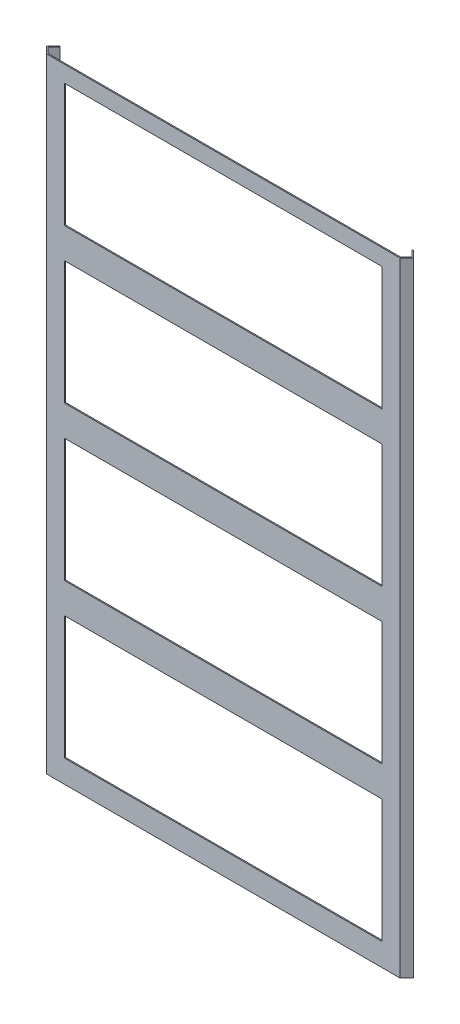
ISO-10303-21;
HEADER;
FILE_DESCRIPTION(('STEP AP214'),'2;1');
FILE_NAME('part.step','',(''),(''),'','','');
FILE_SCHEMA(('AUTOMOTIVE_DESIGN { 1 0 10303 214 1 1 1 1 }'));
ENDSEC;
DATA;
#1=APPLICATION_CONTEXT('core data for automotive mechanical design processes');
#2=APPLICATION_PROTOCOL_DEFINITION('international standard','automotive_design',2000,#1);
#3=PRODUCT_CONTEXT('',#1,'mechanical');
#4=PRODUCT('Part','Part','',(#3));
#5=PRODUCT_RELATED_PRODUCT_CATEGORY('part','',(#4));
#6=PRODUCT_DEFINITION_FORMATION('','',#4);
#7=PRODUCT_DEFINITION_CONTEXT('part definition',#1,'design');
#8=PRODUCT_DEFINITION('design','',#6,#7);
#9=PRODUCT_DEFINITION_SHAPE('','',#8);
#10=(LENGTH_UNIT() NAMED_UNIT(*) SI_UNIT(.MILLI.,.METRE.));
#11=(NAMED_UNIT(*) PLANE_ANGLE_UNIT() SI_UNIT($,.RADIAN.));
#12=(NAMED_UNIT(*) SI_UNIT($,.STERADIAN.) SOLID_ANGLE_UNIT());
#13=UNCERTAINTY_MEASURE_WITH_UNIT(LENGTH_MEASURE(1.E-05),#10,'distance_accuracy_value','');
#14=(GEOMETRIC_REPRESENTATION_CONTEXT(3) GLOBAL_UNCERTAINTY_ASSIGNED_CONTEXT((#13)) GLOBAL_UNIT_ASSIGNED_CONTEXT((#10,
#11,#12)) REPRESENTATION_CONTEXT('',''));
#15=CARTESIAN_POINT('',(0.,0.,0.));
#16=DIRECTION('',(0.,0.,1.));
#17=DIRECTION('',(1.,0.,0.));
#18=AXIS2_PLACEMENT_3D('',#15,#16,#17);
#19=CARTESIAN_POINT('',(0.,2276.,0.));
#20=DIRECTION('',(0.,0.,-1.));
#21=DIRECTION('',(-1.,0.,0.));
#22=AXIS2_PLACEMENT_3D('',#19,#20,#21);
#23=PLANE('',#22);
#24=DIRECTION('',(1.,0.,0.));
#25=VECTOR('',#24,1.);
#26=CARTESIAN_POINT('',(65.,1205.,0.));
#27=LINE('',#26,#25);
#28=CARTESIAN_POINT('',(65.,1205.,0.));
#29=VERTEX_POINT('',#28);
#30=CARTESIAN_POINT('',(1225.,1205.,0.));
#31=VERTEX_POINT('',#30);
#32=EDGE_CURVE('E339',#29,#31,#27,.T.);
#33=ORIENTED_EDGE('',*,*,#32,.T.);
#34=DIRECTION('',(0.,1.,0.));
#35=VECTOR('',#34,1.);
#36=CARTESIAN_POINT('',(1225.,1655.,0.));
#37=LINE('',#36,#35);
#38=CARTESIAN_POINT('',(1225.,1655.,0.));
#39=VERTEX_POINT('',#38);
#40=EDGE_CURVE('E335',#31,#39,#37,.T.);
#41=ORIENTED_EDGE('',*,*,#40,.T.);
#42=DIRECTION('',(-1.,0.,0.));
#43=VECTOR('',#42,1.);
#44=CARTESIAN_POINT('',(64.9999999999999,1655.,0.));
#45=LINE('',#44,#43);
#46=CARTESIAN_POINT('',(64.9999999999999,1655.,0.));
#47=VERTEX_POINT('',#46);
#48=EDGE_CURVE('E349',#39,#47,#45,.T.);
#49=ORIENTED_EDGE('',*,*,#48,.T.);
#50=DIRECTION('',(0.,-1.,0.));
#51=VECTOR('',#50,1.);
#52=CARTESIAN_POINT('',(64.9999999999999,1655.,0.));
#53=LINE('',#52,#51);
#54=EDGE_CURVE('E352',#47,#29,#53,.T.);
#55=ORIENTED_EDGE('',*,*,#54,.T.);
#56=EDGE_LOOP('',(#33,#41,#49,#55));
#57=FACE_BOUND('',#56,.T.);
#58=DIRECTION('',(1.,0.,0.));
#59=VECTOR('',#58,1.);
#60=CARTESIAN_POINT('',(65.0000000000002,83.,0.));
#61=LINE('',#60,#59);
#62=CARTESIAN_POINT('',(65.0000000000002,83.,0.));
#63=VERTEX_POINT('',#62);
#64=CARTESIAN_POINT('',(1225.,83.0000000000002,0.));
#65=VERTEX_POINT('',#64);
#66=EDGE_CURVE('E401',#63,#65,#61,.T.);
#67=ORIENTED_EDGE('',*,*,#66,.T.);
#68=DIRECTION('',(0.,1.,0.));
#69=VECTOR('',#68,1.);
#70=CARTESIAN_POINT('',(1225.,83.,0.));
#71=LINE('',#70,#69);
#72=CARTESIAN_POINT('',(1225.,533.,0.));
#73=VERTEX_POINT('',#72);
#74=EDGE_CURVE('E397',#65,#73,#71,.T.);
#75=ORIENTED_EDGE('',*,*,#74,.T.);
#76=DIRECTION('',(-1.,0.,0.));
#77=VECTOR('',#76,1.);
#78=CARTESIAN_POINT('',(65.0000000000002,533.,0.));
#79=LINE('',#78,#77);
#80=CARTESIAN_POINT('',(65.0000000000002,533.,0.));
#81=VERTEX_POINT('',#80);
#82=EDGE_CURVE('E411',#73,#81,#79,.T.);
#83=ORIENTED_EDGE('',*,*,#82,.T.);
#84=DIRECTION('',(0.,-1.,0.));
#85=VECTOR('',#84,1.);
#86=CARTESIAN_POINT('',(65.0000000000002,83.,0.));
#87=LINE('',#86,#85);
#88=EDGE_CURVE('E414',#81,#63,#87,.T.);
#89=ORIENTED_EDGE('',*,*,#88,.T.);
#90=EDGE_LOOP('',(#67,#75,#83,#89));
#91=FACE_BOUND('',#90,.T.);
#92=DIRECTION('',(1.,0.,0.));
#93=VECTOR('',#92,1.);
#94=CARTESIAN_POINT('',(65.,644.,0.));
#95=LINE('',#94,#93);
#96=CARTESIAN_POINT('',(65.,644.,0.));
#97=VERTEX_POINT('',#96);
#98=CARTESIAN_POINT('',(1225.,644.,0.));
#99=VERTEX_POINT('',#98);
#100=EDGE_CURVE('E370',#97,#99,#95,.T.);
#101=ORIENTED_EDGE('',*,*,#100,.T.);
#102=DIRECTION('',(0.,1.,0.));
#103=VECTOR('',#102,1.);
#104=CARTESIAN_POINT('',(1225.,1094.,0.));
#105=LINE('',#104,#103);
#106=CARTESIAN_POINT('',(1225.,1094.,0.));
#107=VERTEX_POINT('',#106);
#108=EDGE_CURVE('E366',#99,#107,#105,.T.);
#109=ORIENTED_EDGE('',*,*,#108,.T.);
#110=DIRECTION('',(-1.,0.,0.));
#111=VECTOR('',#110,1.);
#112=CARTESIAN_POINT('',(64.9999999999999,1094.,0.));
#113=LINE('',#112,#111);
#114=CARTESIAN_POINT('',(64.9999999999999,1094.,0.));
#115=VERTEX_POINT('',#114);
#116=EDGE_CURVE('E380',#107,#115,#113,.T.);
#117=ORIENTED_EDGE('',*,*,#116,.T.);
#118=DIRECTION('',(0.,-1.,0.));
#119=VECTOR('',#118,1.);
#120=CARTESIAN_POINT('',(64.9999999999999,1094.,0.));
#121=LINE('',#120,#119);
#122=EDGE_CURVE('E383',#115,#97,#121,.T.);
#123=ORIENTED_EDGE('',*,*,#122,.T.);
#124=EDGE_LOOP('',(#101,#109,#117,#123));
#125=FACE_BOUND('',#124,.T.);
#126=DIRECTION('',(1.,0.,0.));
#127=VECTOR('',#126,1.);
#128=CARTESIAN_POINT('',(64.9999999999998,1766.,0.));
#129=LINE('',#128,#127);
#130=CARTESIAN_POINT('',(64.9999999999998,1766.,0.));
#131=VERTEX_POINT('',#130);
#132=CARTESIAN_POINT('',(1225.,1766.,0.));
#133=VERTEX_POINT('',#132);
#134=EDGE_CURVE('E308',#131,#133,#129,.T.);
#135=ORIENTED_EDGE('',*,*,#134,.T.);
#136=DIRECTION('',(0.,1.,0.));
#137=VECTOR('',#136,1.);
#138=CARTESIAN_POINT('',(1225.,2216.,0.));
#139=LINE('',#138,#137);
#140=CARTESIAN_POINT('',(1225.,2216.,0.));
#141=VERTEX_POINT('',#140);
#142=EDGE_CURVE('E304',#133,#141,#139,.T.);
#143=ORIENTED_EDGE('',*,*,#142,.T.);
#144=DIRECTION('',(-1.,0.,0.));
#145=VECTOR('',#144,1.);
#146=CARTESIAN_POINT('',(64.9999999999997,2216.,0.));
#147=LINE('',#146,#145);
#148=CARTESIAN_POINT('',(64.9999999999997,2216.,0.));
#149=VERTEX_POINT('',#148);
#150=EDGE_CURVE('E318',#141,#149,#147,.T.);
#151=ORIENTED_EDGE('',*,*,#150,.T.);
#152=DIRECTION('',(0.,-1.,0.));
#153=VECTOR('',#152,1.);
#154=CARTESIAN_POINT('',(64.9999999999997,2216.,0.));
#155=LINE('',#154,#153);
#156=EDGE_CURVE('E321',#149,#131,#155,.T.);
#157=ORIENTED_EDGE('',*,*,#156,.T.);
#158=EDGE_LOOP('',(#135,#143,#151,#157));
#159=FACE_BOUND('',#158,.T.);
#160=DIRECTION('',(-1.,0.,0.));
#161=VECTOR('',#160,1.);
#162=CARTESIAN_POINT('',(0.,2276.,0.));
#163=LINE('',#162,#161);
#164=CARTESIAN_POINT('',(1288.34314575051,2276.,0.));
#165=VERTEX_POINT('',#164);
#166=CARTESIAN_POINT('',(1.65685424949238,2276.,0.));
#167=VERTEX_POINT('',#166);
#168=EDGE_CURVE('E37',#165,#167,#163,.T.);
#169=ORIENTED_EDGE('',*,*,#168,.F.);
#170=DIRECTION('',(0.,-1.,0.));
#171=VECTOR('',#170,1.);
#172=CARTESIAN_POINT('',(1288.34314575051,2276.,0.));
#173=LINE('',#172,#171);
#174=CARTESIAN_POINT('',(1288.34314575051,0.,0.));
#175=VERTEX_POINT('',#174);
#176=EDGE_CURVE('E262',#165,#175,#173,.T.);
#177=ORIENTED_EDGE('',*,*,#176,.T.);
#178=DIRECTION('',(1.,0.,0.));
#179=VECTOR('',#178,1.);
#180=CARTESIAN_POINT('',(0.,0.,0.));
#181=LINE('',#180,#179);
#182=CARTESIAN_POINT('',(1.65685424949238,0.,0.));
#183=VERTEX_POINT('',#182);
#184=EDGE_CURVE('E50',#183,#175,#181,.T.);
#185=ORIENTED_EDGE('',*,*,#184,.F.);
#186=DIRECTION('',(0.,-1.,0.));
#187=VECTOR('',#186,1.);
#188=CARTESIAN_POINT('',(1.65685424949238,2276.,0.));
#189=LINE('',#188,#187);
#190=EDGE_CURVE('E295',#167,#183,#189,.T.);
#191=ORIENTED_EDGE('',*,*,#190,.F.);
#192=EDGE_LOOP('',(#169,#177,#185,#191));
#193=FACE_BOUND('',#192,.T.);
#194=ADVANCED_FACE('F33',(#57,#91,#125,#159,#193),#23,.T.);
#195=CARTESIAN_POINT('',(0.,2276.,4.));
#196=DIRECTION('',(0.,0.,-1.));
#197=DIRECTION('',(-1.,0.,0.));
#198=AXIS2_PLACEMENT_3D('',#195,#196,#197);
#199=PLANE('',#198);
#200=DIRECTION('',(0.,1.,0.));
#201=VECTOR('',#200,1.);
#202=CARTESIAN_POINT('',(1225.,1655.,4.));
#203=LINE('',#202,#201);
#204=CARTESIAN_POINT('',(1225.,1205.,4.));
#205=VERTEX_POINT('',#204);
#206=CARTESIAN_POINT('',(1225.,1655.,4.));
#207=VERTEX_POINT('',#206);
#208=EDGE_CURVE('E336',#205,#207,#203,.T.);
#209=ORIENTED_EDGE('',*,*,#208,.F.);
#210=DIRECTION('',(1.,0.,0.));
#211=VECTOR('',#210,1.);
#212=CARTESIAN_POINT('',(65.,1205.,4.));
#213=LINE('',#212,#211);
#214=CARTESIAN_POINT('',(65.,1205.,4.));
#215=VERTEX_POINT('',#214);
#216=EDGE_CURVE('E344',#215,#205,#213,.T.);
#217=ORIENTED_EDGE('',*,*,#216,.F.);
#218=DIRECTION('',(0.,-1.,0.));
#219=VECTOR('',#218,1.);
#220=CARTESIAN_POINT('',(64.9999999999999,1655.,4.));
#221=LINE('',#220,#219);
#222=CARTESIAN_POINT('',(64.9999999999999,1655.,4.));
#223=VERTEX_POINT('',#222);
#224=EDGE_CURVE('E341',#223,#215,#221,.T.);
#225=ORIENTED_EDGE('',*,*,#224,.F.);
#226=DIRECTION('',(-1.,0.,0.));
#227=VECTOR('',#226,1.);
#228=CARTESIAN_POINT('',(64.9999999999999,1655.,4.));
#229=LINE('',#228,#227);
#230=EDGE_CURVE('E338',#207,#223,#229,.T.);
#231=ORIENTED_EDGE('',*,*,#230,.F.);
#232=EDGE_LOOP('',(#209,#217,#225,#231));
#233=FACE_BOUND('',#232,.T.);
#234=DIRECTION('',(0.,1.,0.));
#235=VECTOR('',#234,1.);
#236=CARTESIAN_POINT('',(1225.,83.,4.));
#237=LINE('',#236,#235);
#238=CARTESIAN_POINT('',(1225.,83.,4.));
#239=VERTEX_POINT('',#238);
#240=CARTESIAN_POINT('',(1225.,533.,4.));
#241=VERTEX_POINT('',#240);
#242=EDGE_CURVE('E398',#239,#241,#237,.T.);
#243=ORIENTED_EDGE('',*,*,#242,.F.);
#244=DIRECTION('',(1.,0.,0.));
#245=VECTOR('',#244,1.);
#246=CARTESIAN_POINT('',(65.0000000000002,83.,4.));
#247=LINE('',#246,#245);
#248=CARTESIAN_POINT('',(65.0000000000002,83.0000000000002,4.));
#249=VERTEX_POINT('',#248);
#250=EDGE_CURVE('E406',#249,#239,#247,.T.);
#251=ORIENTED_EDGE('',*,*,#250,.F.);
#252=DIRECTION('',(0.,-1.,0.));
#253=VECTOR('',#252,1.);
#254=CARTESIAN_POINT('',(65.0000000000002,83.,4.));
#255=LINE('',#254,#253);
#256=CARTESIAN_POINT('',(65.0000000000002,533.,4.));
#257=VERTEX_POINT('',#256);
#258=EDGE_CURVE('E403',#257,#249,#255,.T.);
#259=ORIENTED_EDGE('',*,*,#258,.F.);
#260=DIRECTION('',(-1.,0.,0.));
#261=VECTOR('',#260,1.);
#262=CARTESIAN_POINT('',(65.0000000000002,533.,4.));
#263=LINE('',#262,#261);
#264=EDGE_CURVE('E400',#241,#257,#263,.T.);
#265=ORIENTED_EDGE('',*,*,#264,.F.);
#266=EDGE_LOOP('',(#243,#251,#259,#265));
#267=FACE_BOUND('',#266,.T.);
#268=DIRECTION('',(0.,-1.,0.));
#269=VECTOR('',#268,1.);
#270=CARTESIAN_POINT('',(0.,0.,4.));
#271=LINE('',#270,#269);
#272=CARTESIAN_POINT('',(0.,2276.,4.));
#273=VERTEX_POINT('',#272);
#274=CARTESIAN_POINT('',(0.,0.,4.));
#275=VERTEX_POINT('',#274);
#276=EDGE_CURVE('E428',#273,#275,#271,.T.);
#277=ORIENTED_EDGE('',*,*,#276,.T.);
#278=DIRECTION('',(1.,0.,0.));
#279=VECTOR('',#278,1.);
#280=CARTESIAN_POINT('',(0.,0.,4.));
#281=LINE('',#280,#279);
#282=CARTESIAN_POINT('',(1290.,0.,4.));
#283=VERTEX_POINT('',#282);
#284=EDGE_CURVE('E431',#275,#283,#281,.T.);
#285=ORIENTED_EDGE('',*,*,#284,.T.);
#286=DIRECTION('',(0.,1.,0.));
#287=VECTOR('',#286,1.);
#288=CARTESIAN_POINT('',(1290.,0.,4.));
#289=LINE('',#288,#287);
#290=CARTESIAN_POINT('',(1290.,2276.,4.));
#291=VERTEX_POINT('',#290);
#292=EDGE_CURVE('E42',#283,#291,#289,.T.);
#293=ORIENTED_EDGE('',*,*,#292,.T.);
#294=DIRECTION('',(-1.,0.,0.));
#295=VECTOR('',#294,1.);
#296=CARTESIAN_POINT('',(0.,2276.,4.));
#297=LINE('',#296,#295);
#298=EDGE_CURVE('E11',#291,#273,#297,.T.);
#299=ORIENTED_EDGE('',*,*,#298,.T.);
#300=EDGE_LOOP('',(#277,#285,#293,#299));
#301=FACE_BOUND('',#300,.T.);
#302=DIRECTION('',(0.,1.,0.));
#303=VECTOR('',#302,1.);
#304=CARTESIAN_POINT('',(1225.,1094.,4.));
#305=LINE('',#304,#303);
#306=CARTESIAN_POINT('',(1225.,644.,4.));
#307=VERTEX_POINT('',#306);
#308=CARTESIAN_POINT('',(1225.,1094.,4.));
#309=VERTEX_POINT('',#308);
#310=EDGE_CURVE('E367',#307,#309,#305,.T.);
#311=ORIENTED_EDGE('',*,*,#310,.F.);
#312=DIRECTION('',(1.,0.,0.));
#313=VECTOR('',#312,1.);
#314=CARTESIAN_POINT('',(65.,644.,4.));
#315=LINE('',#314,#313);
#316=CARTESIAN_POINT('',(65.,644.,4.));
#317=VERTEX_POINT('',#316);
#318=EDGE_CURVE('E375',#317,#307,#315,.T.);
#319=ORIENTED_EDGE('',*,*,#318,.F.);
#320=DIRECTION('',(0.,-1.,0.));
#321=VECTOR('',#320,1.);
#322=CARTESIAN_POINT('',(64.9999999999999,1094.,4.));
#323=LINE('',#322,#321);
#324=CARTESIAN_POINT('',(64.9999999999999,1094.,4.));
#325=VERTEX_POINT('',#324);
#326=EDGE_CURVE('E372',#325,#317,#323,.T.);
#327=ORIENTED_EDGE('',*,*,#326,.F.);
#328=DIRECTION('',(-1.,0.,0.));
#329=VECTOR('',#328,1.);
#330=CARTESIAN_POINT('',(64.9999999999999,1094.,4.));
#331=LINE('',#330,#329);
#332=EDGE_CURVE('E369',#309,#325,#331,.T.);
#333=ORIENTED_EDGE('',*,*,#332,.F.);
#334=EDGE_LOOP('',(#311,#319,#327,#333));
#335=FACE_BOUND('',#334,.T.);
#336=DIRECTION('',(0.,1.,0.));
#337=VECTOR('',#336,1.);
#338=CARTESIAN_POINT('',(1225.,2216.,4.));
#339=LINE('',#338,#337);
#340=CARTESIAN_POINT('',(1225.,1766.,4.));
#341=VERTEX_POINT('',#340);
#342=CARTESIAN_POINT('',(1225.,2216.,4.));
#343=VERTEX_POINT('',#342);
#344=EDGE_CURVE('E305',#341,#343,#339,.T.);
#345=ORIENTED_EDGE('',*,*,#344,.F.);
#346=DIRECTION('',(1.,0.,0.));
#347=VECTOR('',#346,1.);
#348=CARTESIAN_POINT('',(64.9999999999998,1766.,4.));
#349=LINE('',#348,#347);
#350=CARTESIAN_POINT('',(64.9999999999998,1766.,4.));
#351=VERTEX_POINT('',#350);
#352=EDGE_CURVE('E313',#351,#341,#349,.T.);
#353=ORIENTED_EDGE('',*,*,#352,.F.);
#354=DIRECTION('',(0.,-1.,0.));
#355=VECTOR('',#354,1.);
#356=CARTESIAN_POINT('',(64.9999999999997,2216.,4.));
#357=LINE('',#356,#355);
#358=CARTESIAN_POINT('',(64.9999999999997,2216.,4.));
#359=VERTEX_POINT('',#358);
#360=EDGE_CURVE('E310',#359,#351,#357,.T.);
#361=ORIENTED_EDGE('',*,*,#360,.F.);
#362=DIRECTION('',(-1.,0.,0.));
#363=VECTOR('',#362,1.);
#364=CARTESIAN_POINT('',(64.9999999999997,2216.,4.));
#365=LINE('',#364,#363);
#366=EDGE_CURVE('E307',#343,#359,#365,.T.);
#367=ORIENTED_EDGE('',*,*,#366,.F.);
#368=EDGE_LOOP('',(#345,#353,#361,#367));
#369=FACE_BOUND('',#368,.T.);
#370=ADVANCED_FACE('F464',(#233,#267,#301,#335,#369),#199,.F.);
#371=CARTESIAN_POINT('',(0.,0.,4.));
#372=DIRECTION('',(0.,1.,0.));
#373=DIRECTION('',(0.,0.,1.));
#374=AXIS2_PLACEMENT_3D('',#371,#372,#373);
#375=PLANE('',#374);
#376=ORIENTED_EDGE('',*,*,#184,.T.);
#377=DIRECTION('',(0.707106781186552,0.,-0.707106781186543));
#378=VECTOR('',#377,1.);
#379=CARTESIAN_POINT('',(1287.17157287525,0.,1.17157287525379));
#380=LINE('',#379,#378);
#381=CARTESIAN_POINT('',(1309.09188309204,0.,-20.748737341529));
#382=VERTEX_POINT('',#381);
#383=EDGE_CURVE('E252',#175,#382,#380,.T.);
#384=ORIENTED_EDGE('',*,*,#383,.T.);
#385=DIRECTION('',(-0.707106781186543,0.,-0.707106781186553));
#386=VECTOR('',#385,1.);
#387=CARTESIAN_POINT('',(1311.92031021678,0.,-17.9203102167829));
#388=LINE('',#387,#386);
#389=CARTESIAN_POINT('',(1287.17157287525,0.,-42.6690475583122));
#390=VERTEX_POINT('',#389);
#391=EDGE_CURVE('E227',#382,#390,#388,.T.);
#392=ORIENTED_EDGE('',*,*,#391,.T.);
#393=DIRECTION('',(0.707106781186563,0.,-0.707106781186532));
#394=VECTOR('',#393,1.);
#395=CARTESIAN_POINT('',(1287.17157287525,0.,-42.6690475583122));
#396=LINE('',#395,#394);
#397=CARTESIAN_POINT('',(1290.,0.,-45.4974746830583));
#398=VERTEX_POINT('',#397);
#399=EDGE_CURVE('E220',#390,#398,#396,.T.);
#400=ORIENTED_EDGE('',*,*,#399,.T.);
#401=DIRECTION('',(-0.707106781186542,0.,-0.707106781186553));
#402=VECTOR('',#401,1.);
#403=CARTESIAN_POINT('',(1314.74873734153,0.,-20.748737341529));
#404=LINE('',#403,#402);
#405=CARTESIAN_POINT('',(1314.74873734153,0.,-20.748737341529));
#406=VERTEX_POINT('',#405);
#407=EDGE_CURVE('E224',#406,#398,#404,.T.);
#408=ORIENTED_EDGE('',*,*,#407,.F.);
#409=DIRECTION('',(0.707106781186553,0.,-0.707106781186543));
#410=VECTOR('',#409,1.);
#411=CARTESIAN_POINT('',(1290.,0.,4.));
#412=LINE('',#411,#410);
#413=EDGE_CURVE('E241',#283,#406,#412,.T.);
#414=ORIENTED_EDGE('',*,*,#413,.F.);
#415=ORIENTED_EDGE('',*,*,#284,.F.);
#416=DIRECTION('',(-0.707106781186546,0.,-0.707106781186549));
#417=VECTOR('',#416,1.);
#418=CARTESIAN_POINT('',(0.,0.,4.));
#419=LINE('',#418,#417);
#420=CARTESIAN_POINT('',(-24.7487373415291,0.,-20.7487373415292));
#421=VERTEX_POINT('',#420);
#422=EDGE_CURVE('E277',#275,#421,#419,.T.);
#423=ORIENTED_EDGE('',*,*,#422,.T.);
#424=DIRECTION('',(0.707106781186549,0.,-0.707106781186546));
#425=VECTOR('',#424,1.);
#426=CARTESIAN_POINT('',(-24.7487373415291,0.,-20.7487373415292));
#427=LINE('',#426,#425);
#428=CARTESIAN_POINT('',(0.,0.,-45.4974746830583));
#429=VERTEX_POINT('',#428);
#430=EDGE_CURVE('E275',#421,#429,#427,.T.);
#431=ORIENTED_EDGE('',*,*,#430,.T.);
#432=DIRECTION('',(0.707106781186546,0.,0.707106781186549));
#433=VECTOR('',#432,1.);
#434=CARTESIAN_POINT('',(0.,0.,-45.4974746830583));
#435=LINE('',#434,#433);
#436=CARTESIAN_POINT('',(2.82842712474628,0.,-42.6690475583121));
#437=VERTEX_POINT('',#436);
#438=EDGE_CURVE('E272',#429,#437,#435,.T.);
#439=ORIENTED_EDGE('',*,*,#438,.T.);
#440=DIRECTION('',(0.707106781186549,0.,-0.707106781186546));
#441=VECTOR('',#440,1.);
#442=CARTESIAN_POINT('',(-21.9203102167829,0.,-17.920310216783));
#443=LINE('',#442,#441);
#444=CARTESIAN_POINT('',(-19.0918830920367,0.,-20.7487373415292));
#445=VERTEX_POINT('',#444);
#446=EDGE_CURVE('E269',#445,#437,#443,.T.);
#447=ORIENTED_EDGE('',*,*,#446,.F.);
#448=DIRECTION('',(-0.707106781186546,0.,-0.707106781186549));
#449=VECTOR('',#448,1.);
#450=CARTESIAN_POINT('',(2.8284271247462,0.,1.17157287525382));
#451=LINE('',#450,#449);
#452=EDGE_CURVE('E279',#183,#445,#451,.T.);
#453=ORIENTED_EDGE('',*,*,#452,.F.);
#454=EDGE_LOOP('',(#376,#384,#392,#400,#408,#414,#415,#423,#431,#439,#447,#453));
#455=FACE_BOUND('',#454,.T.);
#456=ADVANCED_FACE('F35',(#455),#375,.F.);
#457=CARTESIAN_POINT('',(0.,2276.,4.));
#458=DIRECTION('',(0.,-1.,0.));
#459=DIRECTION('',(0.,0.,-1.));
#460=AXIS2_PLACEMENT_3D('',#457,#458,#459);
#461=PLANE('',#460);
#462=DIRECTION('',(0.707106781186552,0.,-0.707106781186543));
#463=VECTOR('',#462,1.);
#464=CARTESIAN_POINT('',(1287.17157287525,2276.,1.17157287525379));
#465=LINE('',#464,#463);
#466=CARTESIAN_POINT('',(1309.09188309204,2276.,-20.748737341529));
#467=VERTEX_POINT('',#466);
#468=EDGE_CURVE('E248',#165,#467,#465,.T.);
#469=ORIENTED_EDGE('',*,*,#468,.F.);
#470=ORIENTED_EDGE('',*,*,#168,.T.);
#471=DIRECTION('',(-0.707106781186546,0.,-0.707106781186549));
#472=VECTOR('',#471,1.);
#473=CARTESIAN_POINT('',(2.8284271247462,2276.,1.17157287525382));
#474=LINE('',#473,#472);
#475=CARTESIAN_POINT('',(-19.0918830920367,2276.,-20.7487373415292));
#476=VERTEX_POINT('',#475);
#477=EDGE_CURVE('E273',#167,#476,#474,.T.);
#478=ORIENTED_EDGE('',*,*,#477,.T.);
#479=DIRECTION('',(0.707106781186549,0.,-0.707106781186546));
#480=VECTOR('',#479,1.);
#481=CARTESIAN_POINT('',(-21.9203102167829,2276.,-17.920310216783));
#482=LINE('',#481,#480);
#483=CARTESIAN_POINT('',(2.82842712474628,2276.,-42.6690475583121));
#484=VERTEX_POINT('',#483);
#485=EDGE_CURVE('E268',#476,#484,#482,.T.);
#486=ORIENTED_EDGE('',*,*,#485,.T.);
#487=DIRECTION('',(0.707106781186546,0.,0.707106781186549));
#488=VECTOR('',#487,1.);
#489=CARTESIAN_POINT('',(0.,2276.,-45.4974746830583));
#490=LINE('',#489,#488);
#491=CARTESIAN_POINT('',(0.,2276.,-45.4974746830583));
#492=VERTEX_POINT('',#491);
#493=EDGE_CURVE('E284',#492,#484,#490,.T.);
#494=ORIENTED_EDGE('',*,*,#493,.F.);
#495=DIRECTION('',(0.707106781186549,0.,-0.707106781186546));
#496=VECTOR('',#495,1.);
#497=CARTESIAN_POINT('',(-24.7487373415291,2276.,-20.7487373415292));
#498=LINE('',#497,#496);
#499=CARTESIAN_POINT('',(-24.7487373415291,2276.,-20.7487373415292));
#500=VERTEX_POINT('',#499);
#501=EDGE_CURVE('E287',#500,#492,#498,.T.);
#502=ORIENTED_EDGE('',*,*,#501,.F.);
#503=DIRECTION('',(-0.707106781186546,0.,-0.707106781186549));
#504=VECTOR('',#503,1.);
#505=CARTESIAN_POINT('',(0.,2276.,4.));
#506=LINE('',#505,#504);
#507=EDGE_CURVE('E289',#273,#500,#506,.T.);
#508=ORIENTED_EDGE('',*,*,#507,.F.);
#509=ORIENTED_EDGE('',*,*,#298,.F.);
#510=DIRECTION('',(0.707106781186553,0.,-0.707106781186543));
#511=VECTOR('',#510,1.);
#512=CARTESIAN_POINT('',(1290.,2276.,4.));
#513=LINE('',#512,#511);
#514=CARTESIAN_POINT('',(1314.74873734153,2276.,-20.748737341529));
#515=VERTEX_POINT('',#514);
#516=EDGE_CURVE('E245',#291,#515,#513,.T.);
#517=ORIENTED_EDGE('',*,*,#516,.T.);
#518=DIRECTION('',(-0.707106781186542,0.,-0.707106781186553));
#519=VECTOR('',#518,1.);
#520=CARTESIAN_POINT('',(1314.74873734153,2276.,-20.748737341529));
#521=LINE('',#520,#519);
#522=CARTESIAN_POINT('',(1290.,2276.,-45.4974746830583));
#523=VERTEX_POINT('',#522);
#524=EDGE_CURVE('E255',#515,#523,#521,.T.);
#525=ORIENTED_EDGE('',*,*,#524,.T.);
#526=DIRECTION('',(0.707106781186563,0.,-0.707106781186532));
#527=VECTOR('',#526,1.);
#528=CARTESIAN_POINT('',(1287.17157287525,2276.,-42.6690475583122));
#529=LINE('',#528,#527);
#530=CARTESIAN_POINT('',(1287.17157287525,2276.,-42.6690475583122));
#531=VERTEX_POINT('',#530);
#532=EDGE_CURVE('E236',#531,#523,#529,.T.);
#533=ORIENTED_EDGE('',*,*,#532,.F.);
#534=DIRECTION('',(-0.707106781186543,0.,-0.707106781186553));
#535=VECTOR('',#534,1.);
#536=CARTESIAN_POINT('',(1311.92031021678,2276.,-17.9203102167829));
#537=LINE('',#536,#535);
#538=EDGE_CURVE('E258',#467,#531,#537,.T.);
#539=ORIENTED_EDGE('',*,*,#538,.F.);
#540=EDGE_LOOP('',(#469,#470,#478,#486,#494,#502,#508,#509,#517,#525,#533,#539));
#541=FACE_BOUND('',#540,.T.);
#542=ADVANCED_FACE('F447',(#541),#461,.F.);
#543=CARTESIAN_POINT('',(1225.,83.,4.));
#544=DIRECTION('',(-1.,0.,0.));
#545=DIRECTION('',(0.,0.,1.));
#546=AXIS2_PLACEMENT_3D('',#543,#544,#545);
#547=PLANE('',#546);
#548=ORIENTED_EDGE('',*,*,#74,.F.);
#549=DIRECTION('',(0.,0.,-1.));
#550=VECTOR('',#549,1.);
#551=CARTESIAN_POINT('',(1225.,83.,4.));
#552=LINE('',#551,#550);
#553=EDGE_CURVE('E408',#239,#65,#552,.T.);
#554=ORIENTED_EDGE('',*,*,#553,.F.);
#555=ORIENTED_EDGE('',*,*,#242,.T.);
#556=DIRECTION('',(0.,0.,-1.));
#557=VECTOR('',#556,1.);
#558=CARTESIAN_POINT('',(1225.,533.,4.));
#559=LINE('',#558,#557);
#560=EDGE_CURVE('E425',#241,#73,#559,.T.);
#561=ORIENTED_EDGE('',*,*,#560,.T.);
#562=EDGE_LOOP('',(#548,#554,#555,#561));
#563=FACE_BOUND('',#562,.T.);
#564=ADVANCED_FACE('F485',(#563),#547,.T.);
#565=CARTESIAN_POINT('',(65.0000000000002,533.,4.));
#566=DIRECTION('',(0.,-1.,0.));
#567=DIRECTION('',(1.,0.,0.));
#568=AXIS2_PLACEMENT_3D('',#565,#566,#567);
#569=PLANE('',#568);
#570=ORIENTED_EDGE('',*,*,#82,.F.);
#571=ORIENTED_EDGE('',*,*,#560,.F.);
#572=ORIENTED_EDGE('',*,*,#264,.T.);
#573=DIRECTION('',(0.,0.,-1.));
#574=VECTOR('',#573,1.);
#575=CARTESIAN_POINT('',(65.0000000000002,533.,4.));
#576=LINE('',#575,#574);
#577=EDGE_CURVE('E423',#257,#81,#576,.T.);
#578=ORIENTED_EDGE('',*,*,#577,.T.);
#579=EDGE_LOOP('',(#570,#571,#572,#578));
#580=FACE_BOUND('',#579,.T.);
#581=ADVANCED_FACE('F491',(#580),#569,.T.);
#582=CARTESIAN_POINT('',(65.0000000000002,83.,4.));
#583=DIRECTION('',(1.,0.,0.));
#584=DIRECTION('',(0.,0.,-1.));
#585=AXIS2_PLACEMENT_3D('',#582,#583,#584);
#586=PLANE('',#585);
#587=ORIENTED_EDGE('',*,*,#88,.F.);
#588=ORIENTED_EDGE('',*,*,#577,.F.);
#589=ORIENTED_EDGE('',*,*,#258,.T.);
#590=DIRECTION('',(0.,0.,-1.));
#591=VECTOR('',#590,1.);
#592=CARTESIAN_POINT('',(65.0000000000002,83.,4.));
#593=LINE('',#592,#591);
#594=EDGE_CURVE('E421',#249,#63,#593,.T.);
#595=ORIENTED_EDGE('',*,*,#594,.T.);
#596=EDGE_LOOP('',(#587,#588,#589,#595));
#597=FACE_BOUND('',#596,.T.);
#598=ADVANCED_FACE('F604',(#597),#586,.T.);
#599=CARTESIAN_POINT('',(65.0000000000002,83.,4.));
#600=DIRECTION('',(0.,1.,0.));
#601=DIRECTION('',(0.,0.,1.));
#602=AXIS2_PLACEMENT_3D('',#599,#600,#601);
#603=PLANE('',#602);
#604=ORIENTED_EDGE('',*,*,#66,.F.);
#605=ORIENTED_EDGE('',*,*,#594,.F.);
#606=ORIENTED_EDGE('',*,*,#250,.T.);
#607=ORIENTED_EDGE('',*,*,#553,.T.);
#608=EDGE_LOOP('',(#604,#605,#606,#607));
#609=FACE_BOUND('',#608,.T.);
#610=ADVANCED_FACE('F596',(#609),#603,.T.);
#611=CARTESIAN_POINT('',(1225.,1094.,4.));
#612=DIRECTION('',(-1.,0.,0.));
#613=DIRECTION('',(0.,-1.,0.));
#614=AXIS2_PLACEMENT_3D('',#611,#612,#613);
#615=PLANE('',#614);
#616=ORIENTED_EDGE('',*,*,#108,.F.);
#617=DIRECTION('',(0.,0.,-1.));
#618=VECTOR('',#617,1.);
#619=CARTESIAN_POINT('',(1225.,644.,4.));
#620=LINE('',#619,#618);
#621=EDGE_CURVE('E377',#307,#99,#620,.T.);
#622=ORIENTED_EDGE('',*,*,#621,.F.);
#623=ORIENTED_EDGE('',*,*,#310,.T.);
#624=DIRECTION('',(0.,0.,-1.));
#625=VECTOR('',#624,1.);
#626=CARTESIAN_POINT('',(1225.,1094.,4.));
#627=LINE('',#626,#625);
#628=EDGE_CURVE('E394',#309,#107,#627,.T.);
#629=ORIENTED_EDGE('',*,*,#628,.T.);
#630=EDGE_LOOP('',(#616,#622,#623,#629));
#631=FACE_BOUND('',#630,.T.);
#632=ADVANCED_FACE('F588',(#631),#615,.T.);
#633=CARTESIAN_POINT('',(64.9999999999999,1094.,4.));
#634=DIRECTION('',(0.,-1.,0.));
#635=DIRECTION('',(0.,0.,-1.));
#636=AXIS2_PLACEMENT_3D('',#633,#634,#635);
#637=PLANE('',#636);
#638=ORIENTED_EDGE('',*,*,#116,.F.);
#639=ORIENTED_EDGE('',*,*,#628,.F.);
#640=ORIENTED_EDGE('',*,*,#332,.T.);
#641=DIRECTION('',(0.,0.,-1.));
#642=VECTOR('',#641,1.);
#643=CARTESIAN_POINT('',(64.9999999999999,1094.,4.));
#644=LINE('',#643,#642);
#645=EDGE_CURVE('E392',#325,#115,#644,.T.);
#646=ORIENTED_EDGE('',*,*,#645,.T.);
#647=EDGE_LOOP('',(#638,#639,#640,#646));
#648=FACE_BOUND('',#647,.T.);
#649=ADVANCED_FACE('F580',(#648),#637,.T.);
#650=CARTESIAN_POINT('',(64.9999999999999,1094.,4.));
#651=DIRECTION('',(1.,0.,0.));
#652=DIRECTION('',(0.,1.,0.));
#653=AXIS2_PLACEMENT_3D('',#650,#651,#652);
#654=PLANE('',#653);
#655=ORIENTED_EDGE('',*,*,#122,.F.);
#656=ORIENTED_EDGE('',*,*,#645,.F.);
#657=ORIENTED_EDGE('',*,*,#326,.T.);
#658=DIRECTION('',(0.,0.,-1.));
#659=VECTOR('',#658,1.);
#660=CARTESIAN_POINT('',(65.,644.,4.));
#661=LINE('',#660,#659);
#662=EDGE_CURVE('E390',#317,#97,#661,.T.);
#663=ORIENTED_EDGE('',*,*,#662,.T.);
#664=EDGE_LOOP('',(#655,#656,#657,#663));
#665=FACE_BOUND('',#664,.T.);
#666=ADVANCED_FACE('F572',(#665),#654,.T.);
#667=CARTESIAN_POINT('',(65.,644.,4.));
#668=DIRECTION('',(0.,1.,0.));
#669=DIRECTION('',(0.,0.,1.));
#670=AXIS2_PLACEMENT_3D('',#667,#668,#669);
#671=PLANE('',#670);
#672=ORIENTED_EDGE('',*,*,#100,.F.);
#673=ORIENTED_EDGE('',*,*,#662,.F.);
#674=ORIENTED_EDGE('',*,*,#318,.T.);
#675=ORIENTED_EDGE('',*,*,#621,.T.);
#676=EDGE_LOOP('',(#672,#673,#674,#675));
#677=FACE_BOUND('',#676,.T.);
#678=ADVANCED_FACE('F564',(#677),#671,.T.);
#679=CARTESIAN_POINT('',(1225.,1655.,4.));
#680=DIRECTION('',(-1.,0.,0.));
#681=DIRECTION('',(0.,0.,1.));
#682=AXIS2_PLACEMENT_3D('',#679,#680,#681);
#683=PLANE('',#682);
#684=ORIENTED_EDGE('',*,*,#40,.F.);
#685=DIRECTION('',(0.,0.,-1.));
#686=VECTOR('',#685,1.);
#687=CARTESIAN_POINT('',(1225.,1205.,4.));
#688=LINE('',#687,#686);
#689=EDGE_CURVE('E346',#205,#31,#688,.T.);
#690=ORIENTED_EDGE('',*,*,#689,.F.);
#691=ORIENTED_EDGE('',*,*,#208,.T.);
#692=DIRECTION('',(0.,0.,-1.));
#693=VECTOR('',#692,1.);
#694=CARTESIAN_POINT('',(1225.,1655.,4.));
#695=LINE('',#694,#693);
#696=EDGE_CURVE('E363',#207,#39,#695,.T.);
#697=ORIENTED_EDGE('',*,*,#696,.T.);
#698=EDGE_LOOP('',(#684,#690,#691,#697));
#699=FACE_BOUND('',#698,.T.);
#700=ADVANCED_FACE('F556',(#699),#683,.T.);
#701=CARTESIAN_POINT('',(64.9999999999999,1655.,4.));
#702=DIRECTION('',(0.,-1.,0.));
#703=DIRECTION('',(0.,0.,-1.));
#704=AXIS2_PLACEMENT_3D('',#701,#702,#703);
#705=PLANE('',#704);
#706=ORIENTED_EDGE('',*,*,#48,.F.);
#707=ORIENTED_EDGE('',*,*,#696,.F.);
#708=ORIENTED_EDGE('',*,*,#230,.T.);
#709=DIRECTION('',(0.,0.,-1.));
#710=VECTOR('',#709,1.);
#711=CARTESIAN_POINT('',(64.9999999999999,1655.,4.));
#712=LINE('',#711,#710);
#713=EDGE_CURVE('E361',#223,#47,#712,.T.);
#714=ORIENTED_EDGE('',*,*,#713,.T.);
#715=EDGE_LOOP('',(#706,#707,#708,#714));
#716=FACE_BOUND('',#715,.T.);
#717=ADVANCED_FACE('F548',(#716),#705,.T.);
#718=CARTESIAN_POINT('',(64.9999999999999,1655.,4.));
#719=DIRECTION('',(1.,0.,0.));
#720=DIRECTION('',(0.,1.,0.));
#721=AXIS2_PLACEMENT_3D('',#718,#719,#720);
#722=PLANE('',#721);
#723=ORIENTED_EDGE('',*,*,#54,.F.);
#724=ORIENTED_EDGE('',*,*,#713,.F.);
#725=ORIENTED_EDGE('',*,*,#224,.T.);
#726=DIRECTION('',(0.,0.,-1.));
#727=VECTOR('',#726,1.);
#728=CARTESIAN_POINT('',(65.,1205.,4.));
#729=LINE('',#728,#727);
#730=EDGE_CURVE('E359',#215,#29,#729,.T.);
#731=ORIENTED_EDGE('',*,*,#730,.T.);
#732=EDGE_LOOP('',(#723,#724,#725,#731));
#733=FACE_BOUND('',#732,.T.);
#734=ADVANCED_FACE('F540',(#733),#722,.T.);
#735=CARTESIAN_POINT('',(65.,1205.,4.));
#736=DIRECTION('',(0.,1.,0.));
#737=DIRECTION('',(0.,0.,1.));
#738=AXIS2_PLACEMENT_3D('',#735,#736,#737);
#739=PLANE('',#738);
#740=ORIENTED_EDGE('',*,*,#32,.F.);
#741=ORIENTED_EDGE('',*,*,#730,.F.);
#742=ORIENTED_EDGE('',*,*,#216,.T.);
#743=ORIENTED_EDGE('',*,*,#689,.T.);
#744=EDGE_LOOP('',(#740,#741,#742,#743));
#745=FACE_BOUND('',#744,.T.);
#746=ADVANCED_FACE('F532',(#745),#739,.T.);
#747=CARTESIAN_POINT('',(1225.,2216.,4.));
#748=DIRECTION('',(-1.,0.,0.));
#749=DIRECTION('',(0.,0.,1.));
#750=AXIS2_PLACEMENT_3D('',#747,#748,#749);
#751=PLANE('',#750);
#752=ORIENTED_EDGE('',*,*,#142,.F.);
#753=DIRECTION('',(0.,0.,-1.));
#754=VECTOR('',#753,1.);
#755=CARTESIAN_POINT('',(1225.,1766.,4.));
#756=LINE('',#755,#754);
#757=EDGE_CURVE('E315',#341,#133,#756,.T.);
#758=ORIENTED_EDGE('',*,*,#757,.F.);
#759=ORIENTED_EDGE('',*,*,#344,.T.);
#760=DIRECTION('',(0.,0.,-1.));
#761=VECTOR('',#760,1.);
#762=CARTESIAN_POINT('',(1225.,2216.,4.));
#763=LINE('',#762,#761);
#764=EDGE_CURVE('E332',#343,#141,#763,.T.);
#765=ORIENTED_EDGE('',*,*,#764,.T.);
#766=EDGE_LOOP('',(#752,#758,#759,#765));
#767=FACE_BOUND('',#766,.T.);
#768=ADVANCED_FACE('F524',(#767),#751,.T.);
#769=CARTESIAN_POINT('',(64.9999999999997,2216.,4.));
#770=DIRECTION('',(0.,-1.,0.));
#771=DIRECTION('',(1.,0.,0.));
#772=AXIS2_PLACEMENT_3D('',#769,#770,#771);
#773=PLANE('',#772);
#774=ORIENTED_EDGE('',*,*,#150,.F.);
#775=ORIENTED_EDGE('',*,*,#764,.F.);
#776=ORIENTED_EDGE('',*,*,#366,.T.);
#777=DIRECTION('',(0.,0.,-1.));
#778=VECTOR('',#777,1.);
#779=CARTESIAN_POINT('',(64.9999999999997,2216.,4.));
#780=LINE('',#779,#778);
#781=EDGE_CURVE('E330',#359,#149,#780,.T.);
#782=ORIENTED_EDGE('',*,*,#781,.T.);
#783=EDGE_LOOP('',(#774,#775,#776,#782));
#784=FACE_BOUND('',#783,.T.);
#785=ADVANCED_FACE('F516',(#784),#773,.T.);
#786=CARTESIAN_POINT('',(64.9999999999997,2216.,4.));
#787=DIRECTION('',(1.,0.,0.));
#788=DIRECTION('',(0.,1.,0.));
#789=AXIS2_PLACEMENT_3D('',#786,#787,#788);
#790=PLANE('',#789);
#791=ORIENTED_EDGE('',*,*,#156,.F.);
#792=ORIENTED_EDGE('',*,*,#781,.F.);
#793=ORIENTED_EDGE('',*,*,#360,.T.);
#794=DIRECTION('',(0.,0.,-1.));
#795=VECTOR('',#794,1.);
#796=CARTESIAN_POINT('',(64.9999999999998,1766.,4.));
#797=LINE('',#796,#795);
#798=EDGE_CURVE('E328',#351,#131,#797,.T.);
#799=ORIENTED_EDGE('',*,*,#798,.T.);
#800=EDGE_LOOP('',(#791,#792,#793,#799));
#801=FACE_BOUND('',#800,.T.);
#802=ADVANCED_FACE('F507',(#801),#790,.T.);
#803=CARTESIAN_POINT('',(64.9999999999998,1766.,4.));
#804=DIRECTION('',(0.,1.,0.));
#805=DIRECTION('',(0.,0.,1.));
#806=AXIS2_PLACEMENT_3D('',#803,#804,#805);
#807=PLANE('',#806);
#808=ORIENTED_EDGE('',*,*,#134,.F.);
#809=ORIENTED_EDGE('',*,*,#798,.F.);
#810=ORIENTED_EDGE('',*,*,#352,.T.);
#811=ORIENTED_EDGE('',*,*,#757,.T.);
#812=EDGE_LOOP('',(#808,#809,#810,#811));
#813=FACE_BOUND('',#812,.T.);
#814=ADVANCED_FACE('F503',(#813),#807,.T.);
#815=CARTESIAN_POINT('',(-21.9203102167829,0.,-17.920310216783));
#816=DIRECTION('',(0.707106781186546,0.,0.707106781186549));
#817=DIRECTION('',(0.707106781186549,0.,-0.707106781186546));
#818=AXIS2_PLACEMENT_3D('',#815,#816,#817);
#819=PLANE('',#818);
#820=ORIENTED_EDGE('',*,*,#485,.F.);
#821=DIRECTION('',(0.,1.,0.));
#822=VECTOR('',#821,1.);
#823=CARTESIAN_POINT('',(-19.0918830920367,0.,-20.7487373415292));
#824=LINE('',#823,#822);
#825=EDGE_CURVE('E292',#445,#476,#824,.T.);
#826=ORIENTED_EDGE('',*,*,#825,.F.);
#827=ORIENTED_EDGE('',*,*,#446,.T.);
#828=DIRECTION('',(0.,1.,0.));
#829=VECTOR('',#828,1.);
#830=CARTESIAN_POINT('',(2.82842712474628,0.,-42.6690475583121));
#831=LINE('',#830,#829);
#832=EDGE_CURVE('E281',#437,#484,#831,.T.);
#833=ORIENTED_EDGE('',*,*,#832,.T.);
#834=EDGE_LOOP('',(#820,#826,#827,#833));
#835=FACE_BOUND('',#834,.T.);
#836=ADVANCED_FACE('F444',(#835),#819,.T.);
#837=CARTESIAN_POINT('',(2.8284271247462,0.,1.17157287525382));
#838=DIRECTION('',(0.707106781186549,0.,-0.707106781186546));
#839=DIRECTION('',(-0.707106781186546,0.,-0.707106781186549));
#840=AXIS2_PLACEMENT_3D('',#837,#838,#839);
#841=PLANE('',#840);
#842=ORIENTED_EDGE('',*,*,#477,.F.);
#843=ORIENTED_EDGE('',*,*,#190,.T.);
#844=ORIENTED_EDGE('',*,*,#452,.T.);
#845=ORIENTED_EDGE('',*,*,#825,.T.);
#846=EDGE_LOOP('',(#842,#843,#844,#845));
#847=FACE_BOUND('',#846,.T.);
#848=ADVANCED_FACE('F441',(#847),#841,.T.);
#849=CARTESIAN_POINT('',(0.,0.,4.));
#850=DIRECTION('',(0.707106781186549,0.,-0.707106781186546));
#851=DIRECTION('',(-0.707106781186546,0.,-0.707106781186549));
#852=AXIS2_PLACEMENT_3D('',#849,#850,#851);
#853=PLANE('',#852);
#854=ORIENTED_EDGE('',*,*,#507,.T.);
#855=DIRECTION('',(0.,1.,0.));
#856=VECTOR('',#855,1.);
#857=CARTESIAN_POINT('',(-24.7487373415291,0.,-20.7487373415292));
#858=LINE('',#857,#856);
#859=EDGE_CURVE('E296',#421,#500,#858,.T.);
#860=ORIENTED_EDGE('',*,*,#859,.F.);
#861=ORIENTED_EDGE('',*,*,#422,.F.);
#862=ORIENTED_EDGE('',*,*,#276,.F.);
#863=EDGE_LOOP('',(#854,#860,#861,#862));
#864=FACE_BOUND('',#863,.T.);
#865=ADVANCED_FACE('F460',(#864),#853,.F.);
#866=CARTESIAN_POINT('',(-24.7487373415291,0.,-20.7487373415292));
#867=DIRECTION('',(0.707106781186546,0.,0.707106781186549));
#868=DIRECTION('',(0.707106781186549,0.,-0.707106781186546));
#869=AXIS2_PLACEMENT_3D('',#866,#867,#868);
#870=PLANE('',#869);
#871=ORIENTED_EDGE('',*,*,#501,.T.);
#872=DIRECTION('',(0.,1.,0.));
#873=VECTOR('',#872,1.);
#874=CARTESIAN_POINT('',(0.,0.,-45.4974746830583));
#875=LINE('',#874,#873);
#876=EDGE_CURVE('E299',#429,#492,#875,.T.);
#877=ORIENTED_EDGE('',*,*,#876,.F.);
#878=ORIENTED_EDGE('',*,*,#430,.F.);
#879=ORIENTED_EDGE('',*,*,#859,.T.);
#880=EDGE_LOOP('',(#871,#877,#878,#879));
#881=FACE_BOUND('',#880,.T.);
#882=ADVANCED_FACE('F456',(#881),#870,.F.);
#883=CARTESIAN_POINT('',(0.,0.,-45.4974746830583));
#884=DIRECTION('',(-0.707106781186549,0.,0.707106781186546));
#885=DIRECTION('',(0.707106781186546,0.,0.707106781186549));
#886=AXIS2_PLACEMENT_3D('',#883,#884,#885);
#887=PLANE('',#886);
#888=ORIENTED_EDGE('',*,*,#493,.T.);
#889=ORIENTED_EDGE('',*,*,#832,.F.);
#890=ORIENTED_EDGE('',*,*,#438,.F.);
#891=ORIENTED_EDGE('',*,*,#876,.T.);
#892=EDGE_LOOP('',(#888,#889,#890,#891));
#893=FACE_BOUND('',#892,.T.);
#894=ADVANCED_FACE('F451',(#893),#887,.F.);
#895=CARTESIAN_POINT('',(1314.74873734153,0.,-20.748737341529));
#896=DIRECTION('',(0.707106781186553,0.,-0.707106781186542));
#897=DIRECTION('',(-0.707106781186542,0.,-0.707106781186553));
#898=AXIS2_PLACEMENT_3D('',#895,#896,#897);
#899=PLANE('',#898);
#900=ORIENTED_EDGE('',*,*,#524,.F.);
#901=DIRECTION('',(0.,1.,0.));
#902=VECTOR('',#901,1.);
#903=CARTESIAN_POINT('',(1314.74873734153,0.,-20.748737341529));
#904=LINE('',#903,#902);
#905=EDGE_CURVE('E244',#406,#515,#904,.T.);
#906=ORIENTED_EDGE('',*,*,#905,.F.);
#907=ORIENTED_EDGE('',*,*,#407,.T.);
#908=DIRECTION('',(0.,1.,0.));
#909=VECTOR('',#908,1.);
#910=CARTESIAN_POINT('',(1290.,0.,-45.4974746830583));
#911=LINE('',#910,#909);
#912=EDGE_CURVE('E233',#398,#523,#911,.T.);
#913=ORIENTED_EDGE('',*,*,#912,.T.);
#914=EDGE_LOOP('',(#900,#906,#907,#913));
#915=FACE_BOUND('',#914,.T.);
#916=ADVANCED_FACE('F243',(#915),#899,.T.);
#917=CARTESIAN_POINT('',(1290.,0.,4.));
#918=DIRECTION('',(0.707106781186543,0.,0.707106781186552));
#919=DIRECTION('',(0.707106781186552,0.,-0.707106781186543));
#920=AXIS2_PLACEMENT_3D('',#917,#918,#919);
#921=PLANE('',#920);
#922=ORIENTED_EDGE('',*,*,#516,.F.);
#923=ORIENTED_EDGE('',*,*,#292,.F.);
#924=ORIENTED_EDGE('',*,*,#413,.T.);
#925=ORIENTED_EDGE('',*,*,#905,.T.);
#926=EDGE_LOOP('',(#922,#923,#924,#925));
#927=FACE_BOUND('',#926,.T.);
#928=ADVANCED_FACE('F467',(#927),#921,.T.);
#929=CARTESIAN_POINT('',(1287.17157287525,0.,1.17157287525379));
#930=DIRECTION('',(0.707106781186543,0.,0.707106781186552));
#931=DIRECTION('',(0.707106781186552,0.,-0.707106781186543));
#932=AXIS2_PLACEMENT_3D('',#929,#930,#931);
#933=PLANE('',#932);
#934=ORIENTED_EDGE('',*,*,#176,.F.);
#935=ORIENTED_EDGE('',*,*,#468,.T.);
#936=DIRECTION('',(0.,1.,0.));
#937=VECTOR('',#936,1.);
#938=CARTESIAN_POINT('',(1309.09188309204,0.,-20.748737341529));
#939=LINE('',#938,#937);
#940=EDGE_CURVE('E263',#382,#467,#939,.T.);
#941=ORIENTED_EDGE('',*,*,#940,.F.);
#942=ORIENTED_EDGE('',*,*,#383,.F.);
#943=EDGE_LOOP('',(#934,#935,#941,#942));
#944=FACE_BOUND('',#943,.T.);
#945=ADVANCED_FACE('F472',(#944),#933,.F.);
#946=CARTESIAN_POINT('',(1311.92031021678,0.,-17.9203102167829));
#947=DIRECTION('',(0.707106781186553,0.,-0.707106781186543));
#948=DIRECTION('',(-0.707106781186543,0.,-0.707106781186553));
#949=AXIS2_PLACEMENT_3D('',#946,#947,#948);
#950=PLANE('',#949);
#951=ORIENTED_EDGE('',*,*,#538,.T.);
#952=DIRECTION('',(0.,1.,0.));
#953=VECTOR('',#952,1.);
#954=CARTESIAN_POINT('',(1287.17157287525,0.,-42.6690475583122));
#955=LINE('',#954,#953);
#956=EDGE_CURVE('E240',#390,#531,#955,.T.);
#957=ORIENTED_EDGE('',*,*,#956,.F.);
#958=ORIENTED_EDGE('',*,*,#391,.F.);
#959=ORIENTED_EDGE('',*,*,#940,.T.);
#960=EDGE_LOOP('',(#951,#957,#958,#959));
#961=FACE_BOUND('',#960,.T.);
#962=ADVANCED_FACE('F470',(#961),#950,.F.);
#963=CARTESIAN_POINT('',(1287.17157287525,0.,-42.6690475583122));
#964=DIRECTION('',(0.707106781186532,0.,0.707106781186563));
#965=DIRECTION('',(0.707106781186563,0.,-0.707106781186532));
#966=AXIS2_PLACEMENT_3D('',#963,#964,#965);
#967=PLANE('',#966);
#968=ORIENTED_EDGE('',*,*,#532,.T.);
#969=ORIENTED_EDGE('',*,*,#912,.F.);
#970=ORIENTED_EDGE('',*,*,#399,.F.);
#971=ORIENTED_EDGE('',*,*,#956,.T.);
#972=EDGE_LOOP('',(#968,#969,#970,#971));
#973=FACE_BOUND('',#972,.T.);
#974=ADVANCED_FACE('F234',(#973),#967,.F.);
#975=CLOSED_SHELL('',(#194,#370,#456,#542,#564,#581,#598,#610,#632,#649,#666,#678,#700,#717,
#734,#746,#768,#785,#802,#814,#836,#848,#865,#882,#894,#916,#928,#945,#962,#974));
#976=MANIFOLD_SOLID_BREP('B2',#975);
#977=ADVANCED_BREP_SHAPE_REPRESENTATION('',(#18,#976),#14);
#978=SHAPE_DEFINITION_REPRESENTATION(#9,#977);
ENDSEC;
END-ISO-10303-21;
